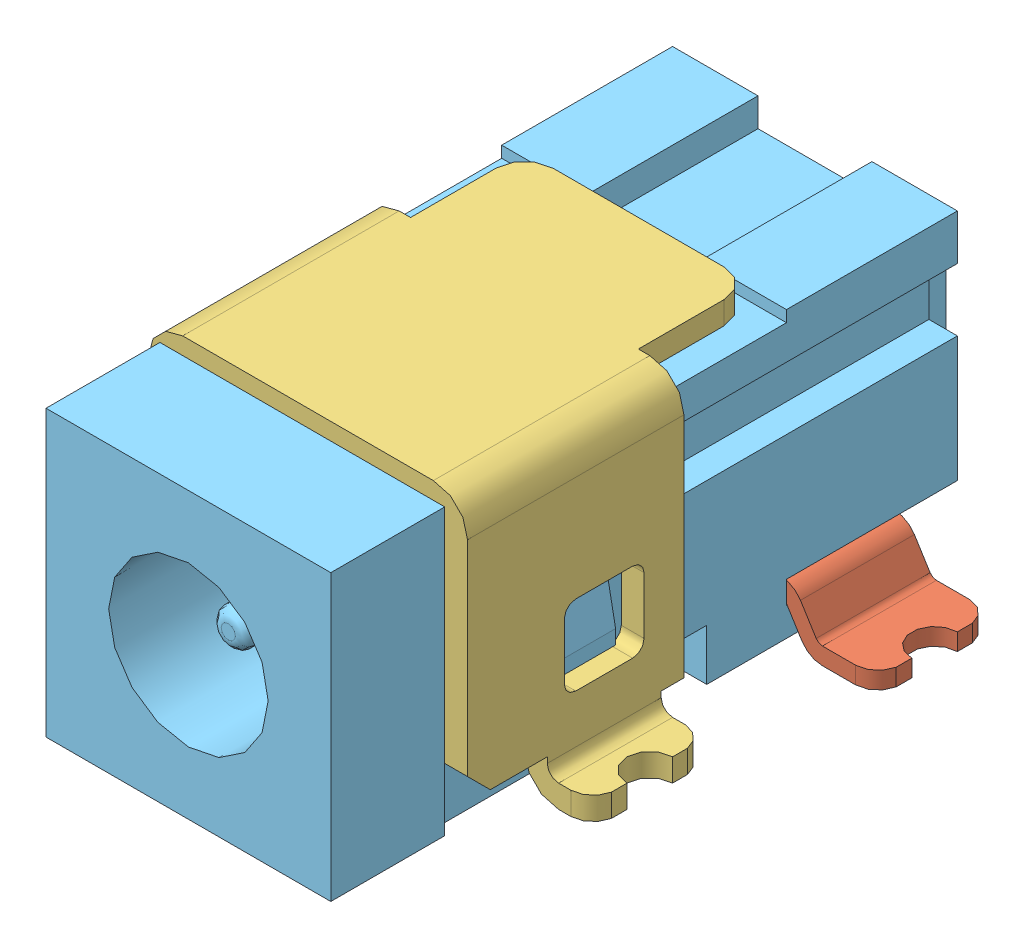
SolidWorks assembly pj-032h-smt-tr_Temp.SLDASM, configuration Default (file format 4100). Lengths in mm.
Overall size (8.2 6 12.3).
5 component instances, 5 part files, 0 mates.
Components (placement in the parent):
- pj-032h-smt-tr_01-1: pj-032h-smt-tr_01.SLDPRT [Default] at origin size (1 3.25 1.15)
- pj-032h-smt-tr_02-1: pj-032h-smt-tr_02.SLDPRT [Default] at origin size (6.4 1 2)
- pj-032h-smt-tr_03-1: pj-032h-smt-tr_03.SLDPRT [Default] at origin size (7.2 5.3 5.8)
- pj-032h-smt-tr_04-1: pj-032h-smt-tr_04.SLDPRT [Default] at origin size (6.2 1.85 2)
- pj-032h-smt-tr_05-1: pj-032h-smt-tr_05.SLDPRT [Default] at origin size (5 5.8 12)
